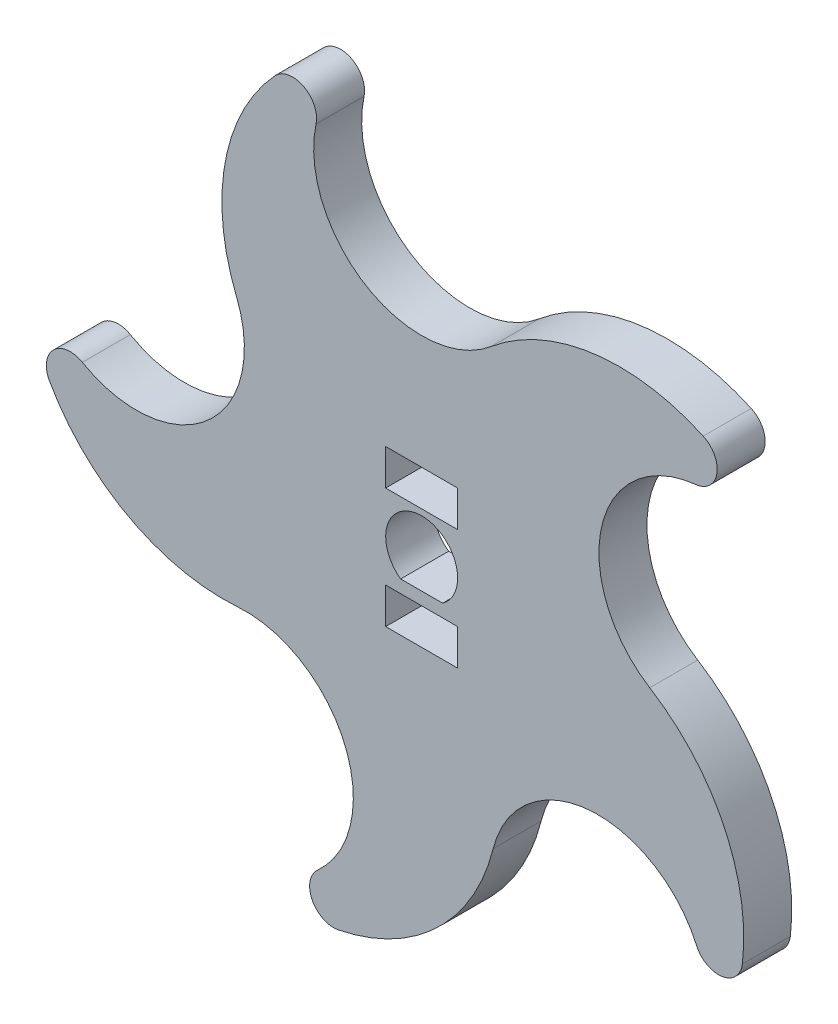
from build123d import *

# Parameters (mm, degrees)
EXTRUDE_1_DEPTH     = 4
SKETCH_3_W          = 6
SKETCH_3_H          = 3
CUT_EXTRUDE_1_DEPTH = 10


with BuildPart() as part:
    # Sketch 2 → Extrude 1 (new body)
    with BuildSketch(Plane.XY):
        with BuildLine():
            ThreePointArc((-8.67701465, -26.917830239), (-6.410026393, -16.708988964), (-15.328244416, -11.247756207))
            ThreePointArc((-15.328244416, -11.247756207), (-24.408696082, -9.291162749), (-31.027899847, -2.77433822))
            ThreePointArc((-31.027899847, -2.77433822), (-30.687341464, -0.373183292), (-28.281722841, -0.065735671))
            ThreePointArc((-28.281722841, -0.065735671), (-17.871999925, 0.932935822), (-15.433939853, 11.102278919))
            ThreePointArc((-15.433939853, 11.102278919), (-16.379122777, 20.342922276), (-12.226700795, 28.651968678))
            ThreePointArc((-12.226700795, 28.651968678), (-9.837828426, 29.070076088), (-8.802051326, 26.877203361))
            ThreePointArc((-8.802051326, 26.877203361), (-4.635477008, 17.285575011), (5.789545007, 18.109341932))
            ThreePointArc((5.789545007, 18.109341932), (14.2858415, 21.863780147), (23.471383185, 20.482228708))
            ThreePointArc((23.471383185, 20.482228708), (24.607229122, 18.33947837), (22.841755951, 16.67676087))
            ThreePointArc((22.841755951, 16.67676087), (15.00711758, 9.75013705), (19.012075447, 0.089909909))
            ThreePointArc((19.012075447, 0.089909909), (25.208258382, -6.830363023), (26.732813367, -15.993255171))
            ThreePointArc((26.732813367, -15.993255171), (25.045932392, -17.73565512), (22.919032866, -16.570398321))
            ThreePointArc((22.919032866, -16.570398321), (13.910385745, -11.259658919), (5.960563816, -18.053774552))
            ThreePointArc((5.960563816, -18.053774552), (1.293718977, -26.08517665), (-6.94959591, -30.366603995))
            ThreePointArc((-6.94959591, -30.366603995), (-9.127991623, -29.300716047), (-8.67701465, -26.917830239))
        make_face()
    extrude(amount=EXTRUDE_1_DEPTH)

    # Sketch 3 → Cut-Extrude 1 (cut)
    with BuildSketch(Plane.XY.offset(4)):
        with Locations((0, 5)):
            Rectangle(SKETCH_3_W, SKETCH_3_H)
        with Locations((0, -5)):
            Rectangle(SKETCH_3_W, SKETCH_3_H)
        with BuildLine():
            Line((1.75, -2.436698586), (-1.75, -2.436698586))
            ThreePointArc((-1.75, -2.436698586), (0, 3), (1.75, -2.436698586))
        make_face()
    extrude(amount=-CUT_EXTRUDE_1_DEPTH, mode=Mode.SUBTRACT)


solid = part.part
